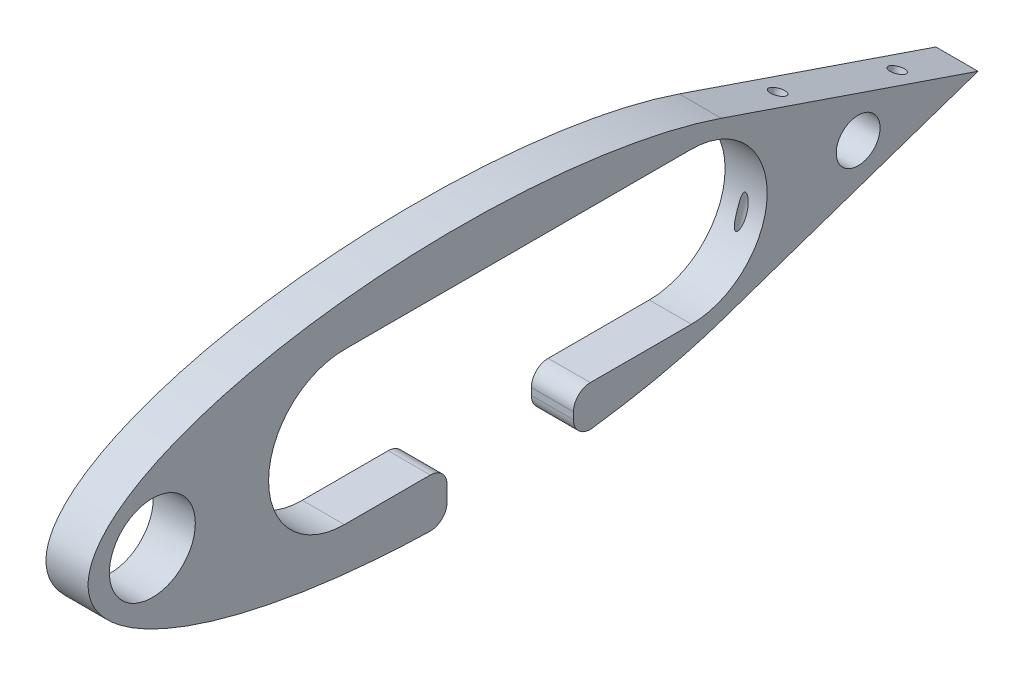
ISO-10303-21;
HEADER;
FILE_DESCRIPTION(('STEP AP214'),'2;1');
FILE_NAME('part.step','',(''),(''),'','','');
FILE_SCHEMA(('AUTOMOTIVE_DESIGN { 1 0 10303 214 1 1 1 1 }'));
ENDSEC;
DATA;
#1=APPLICATION_CONTEXT('core data for automotive mechanical design processes');
#2=APPLICATION_PROTOCOL_DEFINITION('international standard','automotive_design',2000,#1);
#3=PRODUCT_CONTEXT('',#1,'mechanical');
#4=PRODUCT('Part','Part','',(#3));
#5=PRODUCT_RELATED_PRODUCT_CATEGORY('part','',(#4));
#6=PRODUCT_DEFINITION_FORMATION('','',#4);
#7=PRODUCT_DEFINITION_CONTEXT('part definition',#1,'design');
#8=PRODUCT_DEFINITION('design','',#6,#7);
#9=PRODUCT_DEFINITION_SHAPE('','',#8);
#10=(LENGTH_UNIT() NAMED_UNIT(*) SI_UNIT(.MILLI.,.METRE.));
#11=(NAMED_UNIT(*) PLANE_ANGLE_UNIT() SI_UNIT($,.RADIAN.));
#12=(NAMED_UNIT(*) SI_UNIT($,.STERADIAN.) SOLID_ANGLE_UNIT());
#13=UNCERTAINTY_MEASURE_WITH_UNIT(LENGTH_MEASURE(1.E-05),#10,'distance_accuracy_value','');
#14=(GEOMETRIC_REPRESENTATION_CONTEXT(3) GLOBAL_UNCERTAINTY_ASSIGNED_CONTEXT((#13)) GLOBAL_UNIT_ASSIGNED_CONTEXT((#10,
#11,#12)) REPRESENTATION_CONTEXT('',''));
#15=CARTESIAN_POINT('',(0.,0.,0.));
#16=DIRECTION('',(0.,0.,1.));
#17=DIRECTION('',(1.,0.,0.));
#18=AXIS2_PLACEMENT_3D('',#15,#16,#17);
#19=CARTESIAN_POINT('',(3.175,0.,-17.1410506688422));
#20=DIRECTION('',(1.,0.,0.));
#21=DIRECTION('',(0.,0.,1.));
#22=AXIS2_PLACEMENT_3D('',#19,#20,#21);
#23=ELLIPSE('',#22,55.7894923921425,18.8157238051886);
#24=DIRECTION('',(-1.,0.,0.));
#25=VECTOR('',#24,1.);
#26=SURFACE_OF_LINEAR_EXTRUSION('',#23,#25);
#27=CARTESIAN_POINT('',(-3.175,0.,-17.1410506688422));
#28=DIRECTION('',(1.,0.,0.));
#29=DIRECTION('',(0.,0.,1.));
#30=AXIS2_PLACEMENT_3D('',#27,#28,#29);
#31=ELLIPSE('',#30,55.7894923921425,18.8157238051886);
#32=CARTESIAN_POINT('',(-3.175,13.2200854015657,-56.8395555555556));
#33=VERTEX_POINT('',#32);
#34=CARTESIAN_POINT('',(-3.175,-18.7609830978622,-12.8885338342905));
#35=VERTEX_POINT('',#34);
#36=EDGE_CURVE('E208',#33,#35,#31,.T.);
#37=ORIENTED_EDGE('',*,*,#36,.T.);
#38=DIRECTION('',(-1.,0.,0.));
#39=VECTOR('',#38,1.);
#40=CARTESIAN_POINT('',(-3.175,-18.7609830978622,-12.8885338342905));
#41=LINE('',#40,#39);
#42=CARTESIAN_POINT('',(3.175,-18.7609830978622,-12.8885338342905));
#43=VERTEX_POINT('',#42);
#44=EDGE_CURVE('E259',#35,#43,#41,.F.);
#45=ORIENTED_EDGE('',*,*,#44,.T.);
#46=CARTESIAN_POINT('',(3.175,13.2200854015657,-56.8395555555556));
#47=VERTEX_POINT('',#46);
#48=EDGE_CURVE('E211',#47,#43,#23,.T.);
#49=ORIENTED_EDGE('',*,*,#48,.F.);
#50=DIRECTION('',(-1.,0.,0.));
#51=VECTOR('',#50,1.);
#52=CARTESIAN_POINT('',(3.175,13.2200854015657,-56.8395555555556));
#53=LINE('',#52,#51);
#54=EDGE_CURVE('E261',#47,#33,#53,.T.);
#55=ORIENTED_EDGE('',*,*,#54,.T.);
#56=EDGE_LOOP('',(#37,#45,#49,#55));
#57=FACE_BOUND('',#56,.T.);
#58=ADVANCED_FACE('F38',(#57),#26,.F.);
#59=CARTESIAN_POINT('',(3.175,-11.43,0.));
#60=DIRECTION('',(0.,1.,0.));
#61=DIRECTION('',(0.,0.,1.));
#62=AXIS2_PLACEMENT_3D('',#59,#60,#61);
#63=PLANE('',#62);
#64=DIRECTION('',(0.,0.,-1.));
#65=VECTOR('',#64,1.);
#66=CARTESIAN_POINT('',(3.175,-11.43,0.));
#67=LINE('',#66,#65);
#68=CARTESIAN_POINT('',(3.175,-11.43,0.));
#69=VERTEX_POINT('',#68);
#70=CARTESIAN_POINT('',(3.175,-11.43,-12.954));
#71=VERTEX_POINT('',#70);
#72=EDGE_CURVE('E163',#69,#71,#67,.T.);
#73=ORIENTED_EDGE('',*,*,#72,.T.);
#74=DIRECTION('',(1.,0.,0.));
#75=VECTOR('',#74,1.);
#76=CARTESIAN_POINT('',(-3.175,-11.43,-12.954));
#77=LINE('',#76,#75);
#78=CARTESIAN_POINT('',(-3.175,-11.43,-12.954));
#79=VERTEX_POINT('',#78);
#80=EDGE_CURVE('E11',#71,#79,#77,.F.);
#81=ORIENTED_EDGE('',*,*,#80,.T.);
#82=DIRECTION('',(0.,0.,-1.));
#83=VECTOR('',#82,1.);
#84=CARTESIAN_POINT('',(-3.175,-11.43,0.));
#85=LINE('',#84,#83);
#86=CARTESIAN_POINT('',(-3.175,-11.43,0.));
#87=VERTEX_POINT('',#86);
#88=EDGE_CURVE('E166',#87,#79,#85,.T.);
#89=ORIENTED_EDGE('',*,*,#88,.F.);
#90=DIRECTION('',(-1.,0.,0.));
#91=VECTOR('',#90,1.);
#92=CARTESIAN_POINT('',(3.175,-11.43,0.));
#93=LINE('',#92,#91);
#94=EDGE_CURVE('E150',#69,#87,#93,.T.);
#95=ORIENTED_EDGE('',*,*,#94,.F.);
#96=EDGE_LOOP('',(#73,#81,#89,#95));
#97=FACE_BOUND('',#96,.T.);
#98=ADVANCED_FACE('F162',(#97),#63,.T.);
#99=CARTESIAN_POINT('',(3.175,0.,-17.1410506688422));
#100=DIRECTION('',(1.,0.,0.));
#101=DIRECTION('',(0.,0.,-1.));
#102=AXIS2_PLACEMENT_3D('',#99,#100,#101);
#103=PLANE('',#102);
#104=DIRECTION('',(0.,1.,0.));
#105=VECTOR('',#104,1.);
#106=CARTESIAN_POINT('',(3.175,-11.43,-34.544));
#107=LINE('',#106,#105);
#108=CARTESIAN_POINT('',(3.175,-15.0110063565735,-34.544));
#109=VERTEX_POINT('',#108);
#110=CARTESIAN_POINT('',(3.175,-13.97,-34.544));
#111=VERTEX_POINT('',#110);
#112=EDGE_CURVE('E286',#109,#111,#107,.T.);
#113=ORIENTED_EDGE('',*,*,#112,.F.);
#114=CARTESIAN_POINT('',(3.175,-15.0110063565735,-37.084));
#115=DIRECTION('',(1.,0.,0.));
#116=DIRECTION('',(0.,0.,-1.));
#117=AXIS2_PLACEMENT_3D('',#114,#115,#116);
#118=CIRCLE('',#117,2.54);
#119=CARTESIAN_POINT('',(3.175,-17.5293071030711,-37.4153025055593));
#120=VERTEX_POINT('',#119);
#121=EDGE_CURVE('E271',#109,#120,#118,.T.);
#122=ORIENTED_EDGE('',*,*,#121,.T.);
#123=CARTESIAN_POINT('',(3.175,-13.2200854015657,-56.8395555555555));
#124=VERTEX_POINT('',#123);
#125=EDGE_CURVE('E210',#120,#124,#23,.T.);
#126=ORIENTED_EDGE('',*,*,#125,.T.);
#127=DIRECTION('',(0.,0.323232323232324,-0.946319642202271));
#128=VECTOR('',#127,1.);
#129=CARTESIAN_POINT('',(3.175,0.,-95.5436874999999));
#130=LINE('',#129,#128);
#131=CARTESIAN_POINT('',(3.175,0.,-95.5436874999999));
#132=VERTEX_POINT('',#131);
#133=EDGE_CURVE('E204',#124,#132,#130,.T.);
#134=ORIENTED_EDGE('',*,*,#133,.T.);
#135=DIRECTION('',(0.,0.323232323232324,0.946319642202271));
#136=VECTOR('',#135,1.);
#137=CARTESIAN_POINT('',(3.175,13.2200854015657,-56.8395555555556));
#138=LINE('',#137,#136);
#139=EDGE_CURVE('E207',#132,#47,#138,.T.);
#140=ORIENTED_EDGE('',*,*,#139,.T.);
#141=ORIENTED_EDGE('',*,*,#48,.T.);
#142=CARTESIAN_POINT('',(3.175,-16.2218269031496,-12.954));
#143=DIRECTION('',(1.,0.,0.));
#144=DIRECTION('',(0.,0.,-1.));
#145=AXIS2_PLACEMENT_3D('',#142,#143,#144);
#146=CIRCLE('',#145,2.54);
#147=CARTESIAN_POINT('',(3.175,-16.2218269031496,-15.494));
#148=VERTEX_POINT('',#147);
#149=EDGE_CURVE('E53',#43,#148,#146,.T.);
#150=ORIENTED_EDGE('',*,*,#149,.T.);
#151=DIRECTION('',(0.,-1.,0.));
#152=VECTOR('',#151,1.);
#153=CARTESIAN_POINT('',(3.175,-11.43,-15.494));
#154=LINE('',#153,#152);
#155=CARTESIAN_POINT('',(3.175,-13.97,-15.494));
#156=VERTEX_POINT('',#155);
#157=EDGE_CURVE('E280',#156,#148,#154,.T.);
#158=ORIENTED_EDGE('',*,*,#157,.F.);
#159=CARTESIAN_POINT('',(3.175,-13.97,-12.954));
#160=DIRECTION('',(1.,0.,0.));
#161=DIRECTION('',(0.,0.,-1.));
#162=AXIS2_PLACEMENT_3D('',#159,#160,#161);
#163=CIRCLE('',#162,2.54);
#164=EDGE_CURVE('E174',#156,#71,#163,.T.);
#165=ORIENTED_EDGE('',*,*,#164,.T.);
#166=ORIENTED_EDGE('',*,*,#72,.F.);
#167=CARTESIAN_POINT('',(3.175,0.,0.));
#168=DIRECTION('',(1.,0.,0.));
#169=DIRECTION('',(0.,0.,-1.));
#170=AXIS2_PLACEMENT_3D('',#167,#168,#169);
#171=CIRCLE('',#170,11.43);
#172=CARTESIAN_POINT('',(3.175,11.43,0.));
#173=VERTEX_POINT('',#172);
#174=EDGE_CURVE('E147',#173,#69,#171,.T.);
#175=ORIENTED_EDGE('',*,*,#174,.F.);
#176=DIRECTION('',(0.,0.,1.));
#177=VECTOR('',#176,1.);
#178=CARTESIAN_POINT('',(3.175,11.43,0.));
#179=LINE('',#178,#177);
#180=CARTESIAN_POINT('',(3.175,11.43,-52.324));
#181=VERTEX_POINT('',#180);
#182=EDGE_CURVE('E178',#181,#173,#179,.T.);
#183=ORIENTED_EDGE('',*,*,#182,.F.);
#184=CARTESIAN_POINT('',(3.175,0.,-52.324));
#185=DIRECTION('',(1.,0.,0.));
#186=DIRECTION('',(0.,0.,-1.));
#187=AXIS2_PLACEMENT_3D('',#184,#185,#186);
#188=CIRCLE('',#187,11.43);
#189=CARTESIAN_POINT('',(3.175,-11.43,-52.324));
#190=VERTEX_POINT('',#189);
#191=EDGE_CURVE('E175',#190,#181,#188,.T.);
#192=ORIENTED_EDGE('',*,*,#191,.F.);
#193=CARTESIAN_POINT('',(3.175,-11.43,-37.084));
#194=VERTEX_POINT('',#193);
#195=EDGE_CURVE('E157',#194,#190,#67,.T.);
#196=ORIENTED_EDGE('',*,*,#195,.F.);
#197=CARTESIAN_POINT('',(3.175,-13.97,-37.084));
#198=DIRECTION('',(1.,0.,0.));
#199=DIRECTION('',(0.,0.,-1.));
#200=AXIS2_PLACEMENT_3D('',#197,#198,#199);
#201=CIRCLE('',#200,2.54);
#202=EDGE_CURVE('E61',#194,#111,#201,.T.);
#203=ORIENTED_EDGE('',*,*,#202,.T.);
#204=EDGE_LOOP('',(#113,#122,#126,#134,#140,#141,#150,#158,#165,#166,#175,#183,#192,#196,#203));
#205=FACE_BOUND('',#204,.T.);
#206=CARTESIAN_POINT('',(3.175,0.,-77.47));
#207=DIRECTION('',(1.,0.,0.));
#208=DIRECTION('',(0.,0.,-1.));
#209=AXIS2_PLACEMENT_3D('',#206,#207,#208);
#210=CIRCLE('',#209,3.302);
#211=CARTESIAN_POINT('',(3.175,0.,-80.772));
#212=VERTEX_POINT('',#211);
#213=EDGE_CURVE('E198',#212,#212,#210,.T.);
#214=ORIENTED_EDGE('',*,*,#213,.F.);
#215=EDGE_LOOP('',(#214));
#216=FACE_BOUND('',#215,.T.);
#217=CARTESIAN_POINT('',(3.175,0.,28.956));
#218=DIRECTION('',(1.,0.,0.));
#219=DIRECTION('',(0.,0.,-1.));
#220=AXIS2_PLACEMENT_3D('',#217,#218,#219);
#221=CIRCLE('',#220,6.477);
#222=CARTESIAN_POINT('',(3.175,0.,22.479));
#223=VERTEX_POINT('',#222);
#224=EDGE_CURVE('E186',#223,#223,#221,.T.);
#225=ORIENTED_EDGE('',*,*,#224,.F.);
#226=EDGE_LOOP('',(#225));
#227=FACE_BOUND('',#226,.T.);
#228=ADVANCED_FACE('F171',(#205,#216,#227),#103,.T.);
#229=CARTESIAN_POINT('',(-3.175,0.,-17.1410506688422));
#230=DIRECTION('',(1.,0.,0.));
#231=DIRECTION('',(0.,0.,-1.));
#232=AXIS2_PLACEMENT_3D('',#229,#230,#231);
#233=PLANE('',#232);
#234=CARTESIAN_POINT('',(-3.175,0.,-77.47));
#235=DIRECTION('',(1.,0.,0.));
#236=DIRECTION('',(0.,0.,-1.));
#237=AXIS2_PLACEMENT_3D('',#234,#235,#236);
#238=CIRCLE('',#237,3.302);
#239=CARTESIAN_POINT('',(-3.175,0.,-80.772));
#240=VERTEX_POINT('',#239);
#241=EDGE_CURVE('E167',#240,#240,#238,.T.);
#242=ORIENTED_EDGE('',*,*,#241,.T.);
#243=EDGE_LOOP('',(#242));
#244=FACE_BOUND('',#243,.T.);
#245=CARTESIAN_POINT('',(-3.175,-17.5293071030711,-37.4153025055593));
#246=VERTEX_POINT('',#245);
#247=CARTESIAN_POINT('',(-3.175,-13.2200854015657,-56.8395555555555));
#248=VERTEX_POINT('',#247);
#249=EDGE_CURVE('E263',#246,#248,#31,.T.);
#250=ORIENTED_EDGE('',*,*,#249,.F.);
#251=CARTESIAN_POINT('',(-3.175,-15.0110063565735,-37.084));
#252=DIRECTION('',(1.,0.,0.));
#253=DIRECTION('',(0.,0.,-1.));
#254=AXIS2_PLACEMENT_3D('',#251,#252,#253);
#255=CIRCLE('',#254,2.54);
#256=CARTESIAN_POINT('',(-3.175,-15.0110063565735,-34.544));
#257=VERTEX_POINT('',#256);
#258=EDGE_CURVE('E351',#246,#257,#255,.F.);
#259=ORIENTED_EDGE('',*,*,#258,.T.);
#260=DIRECTION('',(0.,1.,0.));
#261=VECTOR('',#260,1.);
#262=CARTESIAN_POINT('',(-3.175,-11.43,-34.544));
#263=LINE('',#262,#261);
#264=CARTESIAN_POINT('',(-3.175,-13.97,-34.544));
#265=VERTEX_POINT('',#264);
#266=EDGE_CURVE('E285',#257,#265,#263,.T.);
#267=ORIENTED_EDGE('',*,*,#266,.T.);
#268=CARTESIAN_POINT('',(-3.175,-13.97,-37.084));
#269=DIRECTION('',(1.,0.,0.));
#270=DIRECTION('',(0.,0.,-1.));
#271=AXIS2_PLACEMENT_3D('',#268,#269,#270);
#272=CIRCLE('',#271,2.54);
#273=CARTESIAN_POINT('',(-3.175,-11.43,-37.084));
#274=VERTEX_POINT('',#273);
#275=EDGE_CURVE('E349',#265,#274,#272,.F.);
#276=ORIENTED_EDGE('',*,*,#275,.T.);
#277=CARTESIAN_POINT('',(-3.175,-11.43,-52.324));
#278=VERTEX_POINT('',#277);
#279=EDGE_CURVE('E185',#274,#278,#85,.T.);
#280=ORIENTED_EDGE('',*,*,#279,.T.);
#281=CARTESIAN_POINT('',(-3.175,0.,-52.324));
#282=DIRECTION('',(1.,0.,0.));
#283=DIRECTION('',(0.,0.,-1.));
#284=AXIS2_PLACEMENT_3D('',#281,#282,#283);
#285=CIRCLE('',#284,11.43);
#286=CARTESIAN_POINT('',(-3.175,11.43,-52.324));
#287=VERTEX_POINT('',#286);
#288=EDGE_CURVE('E188',#278,#287,#285,.T.);
#289=ORIENTED_EDGE('',*,*,#288,.T.);
#290=DIRECTION('',(0.,0.,1.));
#291=VECTOR('',#290,1.);
#292=CARTESIAN_POINT('',(-3.175,11.43,0.));
#293=LINE('',#292,#291);
#294=CARTESIAN_POINT('',(-3.175,11.43,0.));
#295=VERTEX_POINT('',#294);
#296=EDGE_CURVE('E158',#287,#295,#293,.T.);
#297=ORIENTED_EDGE('',*,*,#296,.T.);
#298=CARTESIAN_POINT('',(-3.175,0.,0.));
#299=DIRECTION('',(1.,0.,0.));
#300=DIRECTION('',(0.,0.,-1.));
#301=AXIS2_PLACEMENT_3D('',#298,#299,#300);
#302=CIRCLE('',#301,11.43);
#303=EDGE_CURVE('E183',#295,#87,#302,.T.);
#304=ORIENTED_EDGE('',*,*,#303,.T.);
#305=ORIENTED_EDGE('',*,*,#88,.T.);
#306=CARTESIAN_POINT('',(-3.175,-13.97,-12.954));
#307=DIRECTION('',(1.,0.,0.));
#308=DIRECTION('',(0.,0.,-1.));
#309=AXIS2_PLACEMENT_3D('',#306,#307,#308);
#310=CIRCLE('',#309,2.54);
#311=CARTESIAN_POINT('',(-3.175,-13.97,-15.494));
#312=VERTEX_POINT('',#311);
#313=EDGE_CURVE('E284',#79,#312,#310,.F.);
#314=ORIENTED_EDGE('',*,*,#313,.T.);
#315=DIRECTION('',(0.,-1.,0.));
#316=VECTOR('',#315,1.);
#317=CARTESIAN_POINT('',(-3.175,-11.43,-15.494));
#318=LINE('',#317,#316);
#319=CARTESIAN_POINT('',(-3.175,-16.2218269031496,-15.494));
#320=VERTEX_POINT('',#319);
#321=EDGE_CURVE('E278',#312,#320,#318,.T.);
#322=ORIENTED_EDGE('',*,*,#321,.T.);
#323=CARTESIAN_POINT('',(-3.175,-16.2218269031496,-12.954));
#324=DIRECTION('',(1.,0.,0.));
#325=DIRECTION('',(0.,0.,-1.));
#326=AXIS2_PLACEMENT_3D('',#323,#324,#325);
#327=CIRCLE('',#326,2.54);
#328=EDGE_CURVE('E265',#320,#35,#327,.F.);
#329=ORIENTED_EDGE('',*,*,#328,.T.);
#330=ORIENTED_EDGE('',*,*,#36,.F.);
#331=DIRECTION('',(0.,0.323232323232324,0.946319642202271));
#332=VECTOR('',#331,1.);
#333=CARTESIAN_POINT('',(-3.175,13.2200854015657,-56.8395555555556));
#334=LINE('',#333,#332);
#335=CARTESIAN_POINT('',(-3.175,0.,-95.5436874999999));
#336=VERTEX_POINT('',#335);
#337=EDGE_CURVE('E382',#336,#33,#334,.T.);
#338=ORIENTED_EDGE('',*,*,#337,.F.);
#339=DIRECTION('',(0.,0.323232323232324,-0.946319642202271));
#340=VECTOR('',#339,1.);
#341=CARTESIAN_POINT('',(-3.175,0.,-95.5436874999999));
#342=LINE('',#341,#340);
#343=EDGE_CURVE('E201',#248,#336,#342,.T.);
#344=ORIENTED_EDGE('',*,*,#343,.F.);
#345=EDGE_LOOP('',(#250,#259,#267,#276,#280,#289,#297,#304,#305,#314,#322,#329,#330,#338,#344));
#346=FACE_BOUND('',#345,.T.);
#347=CARTESIAN_POINT('',(-3.175,0.,28.956));
#348=DIRECTION('',(1.,0.,0.));
#349=DIRECTION('',(0.,0.,-1.));
#350=AXIS2_PLACEMENT_3D('',#347,#348,#349);
#351=CIRCLE('',#350,6.477);
#352=CARTESIAN_POINT('',(-3.175,0.,22.479));
#353=VERTEX_POINT('',#352);
#354=EDGE_CURVE('E307',#353,#353,#351,.T.);
#355=ORIENTED_EDGE('',*,*,#354,.T.);
#356=EDGE_LOOP('',(#355));
#357=FACE_BOUND('',#356,.T.);
#358=ADVANCED_FACE('F225',(#244,#346,#357),#233,.F.);
#359=CARTESIAN_POINT('',(3.175,0.,-95.5436874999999));
#360=DIRECTION('',(0.,0.946319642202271,0.323232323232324));
#361=DIRECTION('',(0.,-0.323232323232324,0.946319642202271));
#362=AXIS2_PLACEMENT_3D('',#359,#360,#361);
#363=PLANE('',#362);
#364=CARTESIAN_POINT('',(0.,-3.89206758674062,-84.1489731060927));
#365=DIRECTION('',(0.,0.946319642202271,0.323232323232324));
#366=DIRECTION('',(0.,0.323232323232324,-0.946319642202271));
#367=AXIS2_PLACEMENT_3D('',#364,#365,#366);
#368=ELLIPSE('',#367,1.42887531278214,1.13029999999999);
#369=CARTESIAN_POINT('',(0.,-3.43020889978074,-85.5011458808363));
#370=VERTEX_POINT('',#369);
#371=EDGE_CURVE('E297',#370,#370,#368,.T.);
#372=ORIENTED_EDGE('',*,*,#371,.T.);
#373=EDGE_LOOP('',(#372));
#374=FACE_BOUND('',#373,.T.);
#375=CARTESIAN_POINT('',(0.,-11.6762027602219,-61.3595443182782));
#376=DIRECTION('',(0.,0.946319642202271,0.323232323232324));
#377=DIRECTION('',(0.,0.323232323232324,-0.946319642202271));
#378=AXIS2_PLACEMENT_3D('',#375,#376,#377);
#379=ELLIPSE('',#378,1.42887531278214,1.13029999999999);
#380=CARTESIAN_POINT('',(0.,-11.214344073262,-62.7117170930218));
#381=VERTEX_POINT('',#380);
#382=EDGE_CURVE('E304',#381,#381,#379,.T.);
#383=ORIENTED_EDGE('',*,*,#382,.T.);
#384=EDGE_LOOP('',(#383));
#385=FACE_BOUND('',#384,.T.);
#386=ORIENTED_EDGE('',*,*,#343,.T.);
#387=DIRECTION('',(-1.,0.,0.));
#388=VECTOR('',#387,1.);
#389=CARTESIAN_POINT('',(3.175,0.,-95.5436874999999));
#390=LINE('',#389,#388);
#391=EDGE_CURVE('E342',#132,#336,#390,.T.);
#392=ORIENTED_EDGE('',*,*,#391,.F.);
#393=ORIENTED_EDGE('',*,*,#133,.F.);
#394=DIRECTION('',(-1.,0.,0.));
#395=VECTOR('',#394,1.);
#396=CARTESIAN_POINT('',(3.175,-13.2200854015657,-56.8395555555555));
#397=LINE('',#396,#395);
#398=EDGE_CURVE('E215',#124,#248,#397,.T.);
#399=ORIENTED_EDGE('',*,*,#398,.T.);
#400=EDGE_LOOP('',(#386,#392,#393,#399));
#401=FACE_BOUND('',#400,.T.);
#402=ADVANCED_FACE('F229',(#374,#385,#401),#363,.F.);
#403=CARTESIAN_POINT('',(3.175,13.2200854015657,-56.8395555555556));
#404=DIRECTION('',(0.,-0.946319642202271,0.323232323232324));
#405=DIRECTION('',(0.,-0.323232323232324,-0.946319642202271));
#406=AXIS2_PLACEMENT_3D('',#403,#404,#405);
#407=PLANE('',#406);
#408=CARTESIAN_POINT('',(0.,3.07878787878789,-86.5299929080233));
#409=DIRECTION('',(0.,0.946319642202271,-0.323232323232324));
#410=DIRECTION('',(0.,0.323232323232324,0.946319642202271));
#411=AXIS2_PLACEMENT_3D('',#408,#409,#410);
#412=CIRCLE('',#411,1.13029999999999);
#413=CARTESIAN_POINT('',(0.,3.44413737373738,-85.4603678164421));
#414=VERTEX_POINT('',#413);
#415=EDGE_CURVE('E289',#414,#414,#412,.T.);
#416=ORIENTED_EDGE('',*,*,#415,.F.);
#417=EDGE_LOOP('',(#416));
#418=FACE_BOUND('',#417,.T.);
#419=CARTESIAN_POINT('',(0.,9.23636363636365,-68.5026037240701));
#420=DIRECTION('',(0.,0.946319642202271,-0.323232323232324));
#421=DIRECTION('',(0.,0.323232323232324,0.946319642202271));
#422=AXIS2_PLACEMENT_3D('',#419,#420,#421);
#423=CIRCLE('',#422,1.13029999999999);
#424=CARTESIAN_POINT('',(0.,9.60171313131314,-67.4329786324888));
#425=VERTEX_POINT('',#424);
#426=EDGE_CURVE('E300',#425,#425,#423,.T.);
#427=ORIENTED_EDGE('',*,*,#426,.F.);
#428=EDGE_LOOP('',(#427));
#429=FACE_BOUND('',#428,.T.);
#430=ORIENTED_EDGE('',*,*,#337,.T.);
#431=ORIENTED_EDGE('',*,*,#54,.F.);
#432=ORIENTED_EDGE('',*,*,#139,.F.);
#433=ORIENTED_EDGE('',*,*,#391,.T.);
#434=EDGE_LOOP('',(#430,#431,#432,#433));
#435=FACE_BOUND('',#434,.T.);
#436=ADVANCED_FACE('F223',(#418,#429,#435),#407,.F.);
#437=ORIENTED_EDGE('',*,*,#125,.F.);
#438=DIRECTION('',(-1.,0.,0.));
#439=VECTOR('',#438,1.);
#440=CARTESIAN_POINT('',(3.175,-17.5293071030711,-37.4153025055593));
#441=LINE('',#440,#439);
#442=EDGE_CURVE('E344',#120,#246,#441,.T.);
#443=ORIENTED_EDGE('',*,*,#442,.T.);
#444=ORIENTED_EDGE('',*,*,#249,.T.);
#445=ORIENTED_EDGE('',*,*,#398,.F.);
#446=EDGE_LOOP('',(#437,#443,#444,#445));
#447=FACE_BOUND('',#446,.T.);
#448=ADVANCED_FACE('F218',(#447),#26,.F.);
#449=CARTESIAN_POINT('',(3.175,0.,-77.47));
#450=DIRECTION('',(-1.,0.,0.));
#451=DIRECTION('',(0.,0.,1.));
#452=AXIS2_PLACEMENT_3D('',#449,#450,#451);
#453=CYLINDRICAL_SURFACE('',#452,3.302);
#454=ORIENTED_EDGE('',*,*,#213,.T.);
#455=EDGE_LOOP('',(#454));
#456=FACE_BOUND('',#455,.T.);
#457=ORIENTED_EDGE('',*,*,#241,.F.);
#458=EDGE_LOOP('',(#457));
#459=FACE_BOUND('',#458,.T.);
#460=ADVANCED_FACE('F222',(#456,#459),#453,.F.);
#461=CARTESIAN_POINT('',(3.175,0.,0.));
#462=DIRECTION('',(-1.,0.,0.));
#463=DIRECTION('',(0.,0.,1.));
#464=AXIS2_PLACEMENT_3D('',#461,#462,#463);
#465=CYLINDRICAL_SURFACE('',#464,11.43);
#466=ORIENTED_EDGE('',*,*,#303,.F.);
#467=DIRECTION('',(-1.,0.,0.));
#468=VECTOR('',#467,1.);
#469=CARTESIAN_POINT('',(3.175,11.43,0.));
#470=LINE('',#469,#468);
#471=EDGE_CURVE('E153',#173,#295,#470,.T.);
#472=ORIENTED_EDGE('',*,*,#471,.F.);
#473=ORIENTED_EDGE('',*,*,#174,.T.);
#474=ORIENTED_EDGE('',*,*,#94,.T.);
#475=EDGE_LOOP('',(#466,#472,#473,#474));
#476=FACE_BOUND('',#475,.T.);
#477=ADVANCED_FACE('F149',(#476),#465,.F.);
#478=ORIENTED_EDGE('',*,*,#279,.F.);
#479=DIRECTION('',(1.,0.,0.));
#480=VECTOR('',#479,1.);
#481=CARTESIAN_POINT('',(3.175,-11.43,-37.084));
#482=LINE('',#481,#480);
#483=EDGE_CURVE('E267',#274,#194,#482,.T.);
#484=ORIENTED_EDGE('',*,*,#483,.T.);
#485=ORIENTED_EDGE('',*,*,#195,.T.);
#486=DIRECTION('',(-1.,0.,0.));
#487=VECTOR('',#486,1.);
#488=CARTESIAN_POINT('',(3.175,-11.43,-52.324));
#489=LINE('',#488,#487);
#490=EDGE_CURVE('E168',#190,#278,#489,.T.);
#491=ORIENTED_EDGE('',*,*,#490,.T.);
#492=EDGE_LOOP('',(#478,#484,#485,#491));
#493=FACE_BOUND('',#492,.T.);
#494=ADVANCED_FACE('F254',(#493),#63,.T.);
#495=CARTESIAN_POINT('',(3.175,0.,-52.324));
#496=DIRECTION('',(-1.,0.,0.));
#497=DIRECTION('',(0.,0.,1.));
#498=AXIS2_PLACEMENT_3D('',#495,#496,#497);
#499=CYLINDRICAL_SURFACE('',#498,11.43);
#500=CARTESIAN_POINT('',(0.,-5.80346297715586,-62.1710664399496));
#501=CARTESIAN_POINT('',(0.0137817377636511,-5.80346114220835,-62.1710675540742));
#502=CARTESIAN_POINT('',(0.0275768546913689,-5.80237523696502,-62.1717077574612));
#503=CARTESIAN_POINT('',(0.0547420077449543,-5.79815119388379,-62.174195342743));
#504=CARTESIAN_POINT('',(0.0681112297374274,-5.79500934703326,-62.1760449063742));
#505=CARTESIAN_POINT('',(0.0976142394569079,-5.78589409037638,-62.181401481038));
#506=CARTESIAN_POINT('',(0.113523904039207,-5.77938623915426,-62.18522056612));
#507=CARTESIAN_POINT('',(0.143931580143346,-5.76426298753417,-62.1940683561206));
#508=CARTESIAN_POINT('',(0.158426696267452,-5.75564338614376,-62.1990994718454));
#509=CARTESIAN_POINT('',(0.195336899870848,-5.73059373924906,-62.2136673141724));
#510=CARTESIAN_POINT('',(0.216520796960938,-5.71281004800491,-62.2239583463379));
#511=CARTESIAN_POINT('',(0.255763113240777,-5.67477912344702,-62.2458077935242));
#512=CARTESIAN_POINT('',(0.273812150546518,-5.65452479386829,-62.2573698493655));
#513=CARTESIAN_POINT('',(0.313276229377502,-5.60518781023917,-62.2853163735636));
#514=CARTESIAN_POINT('',(0.333692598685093,-5.5754767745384,-62.301984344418));
#515=CARTESIAN_POINT('',(0.3712669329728,-5.51434413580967,-62.3358999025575));
#516=CARTESIAN_POINT('',(0.388418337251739,-5.48291924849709,-62.3531485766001));
#517=CARTESIAN_POINT('',(0.420257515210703,-5.41880047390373,-62.3879374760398));
#518=CARTESIAN_POINT('',(0.434934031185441,-5.38610157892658,-62.405478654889));
#519=CARTESIAN_POINT('',(0.462234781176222,-5.31991400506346,-62.4405616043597));
#520=CARTESIAN_POINT('',(0.474860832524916,-5.28642605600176,-62.458103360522));
#521=CARTESIAN_POINT('',(0.504733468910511,-5.20080565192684,-62.5024045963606));
#522=CARTESIAN_POINT('',(0.520857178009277,-5.14824672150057,-62.5290950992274));
#523=CARTESIAN_POINT('',(0.550073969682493,-5.04204126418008,-62.5819845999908));
#524=CARTESIAN_POINT('',(0.563165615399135,-4.98839423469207,-62.6081833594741));
#525=CARTESIAN_POINT('',(0.598818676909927,-4.82600185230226,-62.6859016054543));
#526=CARTESIAN_POINT('',(0.617701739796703,-4.71598172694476,-62.736451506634));
#527=CARTESIAN_POINT('',(0.648446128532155,-4.49308320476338,-62.8345674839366));
#528=CARTESIAN_POINT('',(0.66027330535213,-4.38019362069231,-62.8821180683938));
#529=CARTESIAN_POINT('',(0.678079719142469,-4.15270104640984,-62.9736472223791));
#530=CARTESIAN_POINT('',(0.684066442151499,-4.03810044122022,-63.0176302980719));
#531=CARTESIAN_POINT('',(0.692138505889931,-3.76405330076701,-63.1177642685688));
#532=CARTESIAN_POINT('',(0.691912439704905,-3.60393717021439,-63.1722768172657));
#533=CARTESIAN_POINT('',(0.681674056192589,-3.28129516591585,-63.2741904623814));
#534=CARTESIAN_POINT('',(0.671637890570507,-3.11876437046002,-63.3215739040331));
#535=CARTESIAN_POINT('',(0.647677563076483,-2.87487330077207,-63.3868676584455));
#536=CARTESIAN_POINT('',(0.638249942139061,-2.79381565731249,-63.4076123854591));
#537=CARTESIAN_POINT('',(0.615885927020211,-2.63173002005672,-63.4472121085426));
#538=CARTESIAN_POINT('',(0.602950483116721,-2.55070202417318,-63.4660676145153));
#539=CARTESIAN_POINT('',(0.572789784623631,-2.38932203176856,-63.5017836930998));
#540=CARTESIAN_POINT('',(0.555580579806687,-2.30896864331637,-63.5186513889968));
#541=CARTESIAN_POINT('',(0.515521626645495,-2.14930816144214,-63.5503960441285));
#542=CARTESIAN_POINT('',(0.492678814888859,-2.06999990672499,-63.5652754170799));
#543=CARTESIAN_POINT('',(0.4542134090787,-1.95836065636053,-63.5850342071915));
#544=CARTESIAN_POINT('',(0.441905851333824,-1.92504049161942,-63.5907759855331));
#545=CARTESIAN_POINT('',(0.415434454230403,-1.85902939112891,-63.6018556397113));
#546=CARTESIAN_POINT('',(0.401268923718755,-1.82633906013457,-63.6071931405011));
#547=CARTESIAN_POINT('',(0.370724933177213,-1.76212996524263,-63.6173984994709));
#548=CARTESIAN_POINT('',(0.354358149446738,-1.73060606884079,-63.6222686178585));
#549=CARTESIAN_POINT('',(0.318733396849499,-1.66918184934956,-63.6315059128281));
#550=CARTESIAN_POINT('',(0.29948081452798,-1.63927863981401,-63.6358740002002));
#551=CARTESIAN_POINT('',(0.262007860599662,-1.58878751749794,-63.6430612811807));
#552=CARTESIAN_POINT('',(0.244573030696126,-1.56764151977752,-63.6460053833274));
#553=CARTESIAN_POINT('',(0.20684220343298,-1.52798845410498,-63.6514245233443));
#554=CARTESIAN_POINT('',(0.186554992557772,-1.50947362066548,-63.6539009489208));
#555=CARTESIAN_POINT('',(0.151919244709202,-1.48380615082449,-63.6572833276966));
#556=CARTESIAN_POINT('',(0.138704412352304,-1.47516621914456,-63.658409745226));
#557=CARTESIAN_POINT('',(0.11113230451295,-1.4598941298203,-63.6603869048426));
#558=CARTESIAN_POINT('',(0.0967765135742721,-1.45325941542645,-63.6612379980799));
#559=CARTESIAN_POINT('',(0.0692840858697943,-1.44338690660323,-63.6624988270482));
#560=CARTESIAN_POINT('',(0.0562795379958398,-1.43979261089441,-63.6629551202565));
#561=CARTESIAN_POINT('',(0.0298453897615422,-1.43483728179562,-63.6635832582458));
#562=CARTESIAN_POINT('',(0.0164161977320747,-1.43347416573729,-63.6637553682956));
#563=CARTESIAN_POINT('',(-0.0104999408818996,-1.43312698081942,-63.663799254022));
#564=CARTESIAN_POINT('',(-0.0239869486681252,-1.43414741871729,-63.6636704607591));
#565=CARTESIAN_POINT('',(-0.0505863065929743,-1.43846183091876,-63.663123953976));
#566=CARTESIAN_POINT('',(-0.0636983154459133,-1.44175781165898,-63.662705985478));
#567=CARTESIAN_POINT('',(-0.0926811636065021,-1.45146117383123,-63.6614684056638));
#568=CARTESIAN_POINT('',(-0.108346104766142,-1.45846678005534,-63.6605710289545));
#569=CARTESIAN_POINT('',(-0.138343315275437,-1.47486137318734,-63.6584498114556));
#570=CARTESIAN_POINT('',(-0.152672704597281,-1.48425535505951,-63.657225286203));
#571=CARTESIAN_POINT('',(-0.188904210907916,-1.5114157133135,-63.6536429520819));
#572=CARTESIAN_POINT('',(-0.209668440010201,-1.53065310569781,-63.6510661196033));
#573=CARTESIAN_POINT('',(-0.248211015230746,-1.57182697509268,-63.6454264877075));
#574=CARTESIAN_POINT('',(-0.265980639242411,-1.59377102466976,-63.6423623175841));
#575=CARTESIAN_POINT('',(-0.304445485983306,-1.64658256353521,-63.6348170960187));
#576=CARTESIAN_POINT('',(-0.324262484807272,-1.67806162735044,-63.630196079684));
#577=CARTESIAN_POINT('',(-0.360841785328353,-1.74269171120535,-63.6204154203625));
#578=CARTESIAN_POINT('',(-0.377598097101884,-1.77584585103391,-63.6152547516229));
#579=CARTESIAN_POINT('',(-0.408792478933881,-1.84332922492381,-63.6044348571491));
#580=CARTESIAN_POINT('',(-0.423219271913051,-1.87766325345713,-63.5987734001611));
#581=CARTESIAN_POINT('',(-0.450127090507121,-1.94696593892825,-63.5870129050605));
#582=CARTESIAN_POINT('',(-0.462609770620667,-1.98193402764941,-63.5809142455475));
#583=CARTESIAN_POINT('',(-0.492229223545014,-2.07108776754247,-63.564929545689));
#584=CARTESIAN_POINT('',(-0.508297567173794,-2.12557634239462,-63.5547582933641));
#585=CARTESIAN_POINT('',(-0.537547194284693,-2.23514775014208,-63.5334664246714));
#586=CARTESIAN_POINT('',(-0.550727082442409,-2.29023085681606,-63.5223453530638));
#587=CARTESIAN_POINT('',(-0.586817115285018,-2.45613079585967,-63.4875605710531));
#588=CARTESIAN_POINT('',(-0.606223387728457,-2.56742057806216,-63.4625069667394));
#589=CARTESIAN_POINT('',(-0.638353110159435,-2.7903672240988,-63.4087625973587));
#590=CARTESIAN_POINT('',(-0.651057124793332,-2.90202422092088,-63.3800615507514));
#591=CARTESIAN_POINT('',(-0.671008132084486,-3.12474805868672,-63.3191882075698));
#592=CARTESIAN_POINT('',(-0.678260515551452,-3.23581537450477,-63.2870193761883));
#593=CARTESIAN_POINT('',(-0.689313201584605,-3.48620167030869,-63.2103515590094));
#594=CARTESIAN_POINT('',(-0.691704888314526,-3.62527224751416,-63.1648342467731));
#595=CARTESIAN_POINT('',(-0.689284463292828,-3.90161705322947,-63.0684741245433));
#596=CARTESIAN_POINT('',(-0.684466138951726,-4.03888962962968,-63.0176267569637));
#597=CARTESIAN_POINT('',(-0.666990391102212,-4.31020466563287,-62.9111679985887));
#598=CARTESIAN_POINT('',(-0.654378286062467,-4.44426117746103,-62.8555857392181));
#599=CARTESIAN_POINT('',(-0.628081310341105,-4.64279416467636,-62.7688351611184));
#600=CARTESIAN_POINT('',(-0.618092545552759,-4.70851496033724,-62.7393706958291));
#601=CARTESIAN_POINT('',(-0.595179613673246,-4.83896024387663,-62.6794096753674));
#602=CARTESIAN_POINT('',(-0.582256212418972,-4.90368498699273,-62.6489133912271));
#603=CARTESIAN_POINT('',(-0.555613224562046,-5.01958767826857,-62.5929799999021));
#604=CARTESIAN_POINT('',(-0.5425219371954,-5.07098251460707,-62.5676946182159));
#605=CARTESIAN_POINT('',(-0.513391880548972,-5.17283056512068,-62.516642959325));
#606=CARTESIAN_POINT('',(-0.497347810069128,-5.22328190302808,-62.4908758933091));
#607=CARTESIAN_POINT('',(-0.459839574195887,-5.32735372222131,-62.4367620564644));
#608=CARTESIAN_POINT('',(-0.438010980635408,-5.3808348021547,-62.4083974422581));
#609=CARTESIAN_POINT('',(-0.388154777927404,-5.48501537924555,-62.3521086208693));
#610=CARTESIAN_POINT('',(-0.360149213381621,-5.53572398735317,-62.3241832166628));
#611=CARTESIAN_POINT('',(-0.314617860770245,-5.60235837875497,-62.2868783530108));
#612=CARTESIAN_POINT('',(-0.30118119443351,-5.62056324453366,-62.2766168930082));
#613=CARTESIAN_POINT('',(-0.272474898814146,-5.65586322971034,-62.2565988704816));
#614=CARTESIAN_POINT('',(-0.257201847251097,-5.67295618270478,-62.2468433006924));
#615=CARTESIAN_POINT('',(-0.224259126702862,-5.7056367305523,-62.2280884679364));
#616=CARTESIAN_POINT('',(-0.20656400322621,-5.72120483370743,-62.2190991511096));
#617=CARTESIAN_POINT('',(-0.168453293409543,-5.74959273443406,-62.2026309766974));
#618=CARTESIAN_POINT('',(-0.148048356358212,-5.76242280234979,-62.1951464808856));
#619=CARTESIAN_POINT('',(-0.113566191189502,-5.77922564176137,-62.1853134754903));
#620=CARTESIAN_POINT('',(-0.10044278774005,-5.78465310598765,-62.1821294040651));
#621=CARTESIAN_POINT('',(-0.0733663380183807,-5.7936225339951,-62.176860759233));
#622=CARTESIAN_POINT('',(-0.0594156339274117,-5.79716956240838,-62.1747732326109));
#623=CARTESIAN_POINT('',(-0.0377766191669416,-5.80087400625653,-62.172591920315));
#624=CARTESIAN_POINT('',(-0.0302677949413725,-5.80184120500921,-62.172022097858));
#625=CARTESIAN_POINT('',(-0.0151740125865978,-5.80313628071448,-62.1712590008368));
#626=CARTESIAN_POINT('',(-0.00758903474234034,-5.80346398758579,-62.1710658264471));
#627=CARTESIAN_POINT('',(0.,-5.80346297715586,-62.1710664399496));
#628=B_SPLINE_CURVE_WITH_KNOTS('',3,(#500,#501,#502,#503,#504,#505,#506,#507,#508,#509,#510,
#511,#512,#513,#514,#515,#516,#517,#518,#519,#520,#521,#522,#523,#524,#525,#526,#527,#528,#529,
#530,#531,#532,#533,#534,#535,#536,#537,#538,#539,#540,#541,#542,#543,#544,#545,#546,#547,#548,
#549,#550,#551,#552,#553,#554,#555,#556,#557,#558,#559,#560,#561,#562,#563,#564,#565,#566,#567,
#568,#569,#570,#571,#572,#573,#574,#575,#576,#577,#578,#579,#580,#581,#582,#583,#584,#585,#586,
#587,#588,#589,#590,#591,#592,#593,#594,#595,#596,#597,#598,#599,#600,#601,#602,#603,#604,#605,
#606,#607,#608,#609,#610,#611,#612,#613,#614,#615,#616,#617,#618,#619,#620,#621,#622,#623,#624,
#625,#626,#627),.UNSPECIFIED.,.T.,.F.,(4,2,2,2,2,2,2,2,2,2,2,2,2,2,2,2,2,2,2,2,2,2,2,2,2,2,2,2,
2,2,2,2,2,2,2,2,2,2,2,2,2,2,2,2,2,2,2,2,2,2,2,2,2,2,2,2,2,2,2,2,2,2,2,4),(0.,0.0413142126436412,
0.0827031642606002,0.135229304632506,0.187860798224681,0.275895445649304,0.364189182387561,
0.483057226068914,0.602161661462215,0.721794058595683,0.841319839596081,1.02453525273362,
1.20783731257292,1.57505920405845,1.94404425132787,2.31255572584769,2.81954454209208,
3.32776891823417,3.58029688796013,3.83275651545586,4.08428202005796,4.33549935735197,
4.44340367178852,4.55140689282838,4.65885829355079,4.76611157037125,4.84863514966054,
4.93090987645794,4.97826692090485,5.02556332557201,5.06589000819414,5.10617902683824,
5.14654428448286,5.18694517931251,5.23820662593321,5.28957617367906,5.3743637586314,
5.45939418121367,5.57158198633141,5.68398704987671,5.79692092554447,5.90975815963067,
6.08277502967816,6.25587529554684,6.60263897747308,6.9504027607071,7.29782220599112,
7.73656890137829,8.17569386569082,8.61228917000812,8.83037326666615,9.04840051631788,
9.22460352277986,9.40112601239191,9.59400179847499,9.78620007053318,9.86066462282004,
9.93527016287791,10.0107305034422,10.0859026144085,10.1294189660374,10.1728175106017,
10.1955614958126,10.2183115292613),.UNSPECIFIED.);
#629=CARTESIAN_POINT('',(0.,-5.80346297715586,-62.1710664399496));
#630=VERTEX_POINT('',#629);
#631=EDGE_CURVE('E303',#630,#630,#628,.T.);
#632=ORIENTED_EDGE('',*,*,#631,.F.);
#633=EDGE_LOOP('',(#632));
#634=FACE_BOUND('',#633,.T.);
#635=ORIENTED_EDGE('',*,*,#288,.F.);
#636=ORIENTED_EDGE('',*,*,#490,.F.);
#637=ORIENTED_EDGE('',*,*,#191,.T.);
#638=DIRECTION('',(-1.,0.,0.));
#639=VECTOR('',#638,1.);
#640=CARTESIAN_POINT('',(3.175,11.43,-52.324));
#641=LINE('',#640,#639);
#642=EDGE_CURVE('E194',#181,#287,#641,.T.);
#643=ORIENTED_EDGE('',*,*,#642,.T.);
#644=EDGE_LOOP('',(#635,#636,#637,#643));
#645=FACE_BOUND('',#644,.T.);
#646=ADVANCED_FACE('F325',(#634,#645),#499,.F.);
#647=CARTESIAN_POINT('',(3.175,11.43,0.));
#648=DIRECTION('',(0.,-1.,0.));
#649=DIRECTION('',(0.,0.,-1.));
#650=AXIS2_PLACEMENT_3D('',#647,#648,#649);
#651=PLANE('',#650);
#652=ORIENTED_EDGE('',*,*,#296,.F.);
#653=ORIENTED_EDGE('',*,*,#642,.F.);
#654=ORIENTED_EDGE('',*,*,#182,.T.);
#655=ORIENTED_EDGE('',*,*,#471,.T.);
#656=EDGE_LOOP('',(#652,#653,#654,#655));
#657=FACE_BOUND('',#656,.T.);
#658=ADVANCED_FACE('F315',(#657),#651,.T.);
#659=CARTESIAN_POINT('',(3.175,0.,28.956));
#660=DIRECTION('',(-1.,0.,0.));
#661=DIRECTION('',(0.,0.,1.));
#662=AXIS2_PLACEMENT_3D('',#659,#660,#661);
#663=CYLINDRICAL_SURFACE('',#662,6.477);
#664=ORIENTED_EDGE('',*,*,#224,.T.);
#665=EDGE_LOOP('',(#664));
#666=FACE_BOUND('',#665,.T.);
#667=ORIENTED_EDGE('',*,*,#354,.F.);
#668=EDGE_LOOP('',(#667));
#669=FACE_BOUND('',#668,.T.);
#670=ADVANCED_FACE('F312',(#666,#669),#663,.F.);
#671=CARTESIAN_POINT('',(0.,9.23636363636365,-68.5026037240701));
#672=DIRECTION('',(0.,0.946319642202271,-0.323232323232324));
#673=DIRECTION('',(0.,0.323232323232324,0.946319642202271));
#674=AXIS2_PLACEMENT_3D('',#671,#672,#673);
#675=CYLINDRICAL_SURFACE('',#674,1.13029999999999);
#676=ORIENTED_EDGE('',*,*,#426,.T.);
#677=EDGE_LOOP('',(#676));
#678=FACE_BOUND('',#677,.T.);
#679=ORIENTED_EDGE('',*,*,#631,.T.);
#680=EDGE_LOOP('',(#679));
#681=FACE_BOUND('',#680,.T.);
#682=ORIENTED_EDGE('',*,*,#382,.F.);
#683=EDGE_LOOP('',(#682));
#684=FACE_BOUND('',#683,.T.);
#685=ADVANCED_FACE('F314',(#678,#681,#684),#675,.F.);
#686=CARTESIAN_POINT('',(0.,3.07878787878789,-86.5299929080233));
#687=DIRECTION('',(0.,0.946319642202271,-0.323232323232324));
#688=DIRECTION('',(0.,0.323232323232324,0.946319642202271));
#689=AXIS2_PLACEMENT_3D('',#686,#687,#688);
#690=CYLINDRICAL_SURFACE('',#689,1.13029999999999);
#691=ORIENTED_EDGE('',*,*,#415,.T.);
#692=EDGE_LOOP('',(#691));
#693=FACE_BOUND('',#692,.T.);
#694=ORIENTED_EDGE('',*,*,#371,.F.);
#695=EDGE_LOOP('',(#694));
#696=FACE_BOUND('',#695,.T.);
#697=ADVANCED_FACE('F322',(#693,#696),#690,.F.);
#698=CARTESIAN_POINT('',(-3.175,-11.43,-34.544));
#699=DIRECTION('',(0.,0.,-1.));
#700=DIRECTION('',(-1.,0.,0.));
#701=AXIS2_PLACEMENT_3D('',#698,#699,#700);
#702=PLANE('',#701);
#703=ORIENTED_EDGE('',*,*,#266,.F.);
#704=DIRECTION('',(-1.,0.,0.));
#705=VECTOR('',#704,1.);
#706=CARTESIAN_POINT('',(-3.175,-15.0110063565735,-34.544));
#707=LINE('',#706,#705);
#708=EDGE_CURVE('E355',#257,#109,#707,.F.);
#709=ORIENTED_EDGE('',*,*,#708,.T.);
#710=ORIENTED_EDGE('',*,*,#112,.T.);
#711=DIRECTION('',(1.,0.,0.));
#712=VECTOR('',#711,1.);
#713=CARTESIAN_POINT('',(-3.175,-13.97,-34.544));
#714=LINE('',#713,#712);
#715=EDGE_CURVE('E353',#111,#265,#714,.F.);
#716=ORIENTED_EDGE('',*,*,#715,.T.);
#717=EDGE_LOOP('',(#703,#709,#710,#716));
#718=FACE_BOUND('',#717,.T.);
#719=ADVANCED_FACE('F370',(#718),#702,.F.);
#720=CARTESIAN_POINT('',(-3.175,-11.43,-15.494));
#721=DIRECTION('',(0.,0.,1.));
#722=DIRECTION('',(0.,-1.,0.));
#723=AXIS2_PLACEMENT_3D('',#720,#721,#722);
#724=PLANE('',#723);
#725=ORIENTED_EDGE('',*,*,#157,.T.);
#726=DIRECTION('',(-1.,0.,0.));
#727=VECTOR('',#726,1.);
#728=CARTESIAN_POINT('',(-3.175,-16.2218269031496,-15.494));
#729=LINE('',#728,#727);
#730=EDGE_CURVE('E46',#148,#320,#729,.T.);
#731=ORIENTED_EDGE('',*,*,#730,.T.);
#732=ORIENTED_EDGE('',*,*,#321,.F.);
#733=DIRECTION('',(1.,0.,0.));
#734=VECTOR('',#733,1.);
#735=CARTESIAN_POINT('',(3.175,-13.97,-15.494));
#736=LINE('',#735,#734);
#737=EDGE_CURVE('E266',#312,#156,#736,.T.);
#738=ORIENTED_EDGE('',*,*,#737,.T.);
#739=EDGE_LOOP('',(#725,#731,#732,#738));
#740=FACE_BOUND('',#739,.T.);
#741=ADVANCED_FACE('F238',(#740),#724,.F.);
#742=CARTESIAN_POINT('',(0.,-15.0110063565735,-37.084));
#743=DIRECTION('',(-1.,0.,0.));
#744=DIRECTION('',(0.,0.,1.));
#745=AXIS2_PLACEMENT_3D('',#742,#743,#744);
#746=CYLINDRICAL_SURFACE('',#745,2.54);
#747=ORIENTED_EDGE('',*,*,#121,.F.);
#748=ORIENTED_EDGE('',*,*,#708,.F.);
#749=ORIENTED_EDGE('',*,*,#258,.F.);
#750=ORIENTED_EDGE('',*,*,#442,.F.);
#751=EDGE_LOOP('',(#747,#748,#749,#750));
#752=FACE_BOUND('',#751,.T.);
#753=ADVANCED_FACE('F234',(#752),#746,.T.);
#754=CARTESIAN_POINT('',(3.175,-13.97,-37.084));
#755=DIRECTION('',(-1.,0.,0.));
#756=DIRECTION('',(0.,0.,1.));
#757=AXIS2_PLACEMENT_3D('',#754,#755,#756);
#758=CYLINDRICAL_SURFACE('',#757,2.54);
#759=ORIENTED_EDGE('',*,*,#275,.F.);
#760=ORIENTED_EDGE('',*,*,#715,.F.);
#761=ORIENTED_EDGE('',*,*,#202,.F.);
#762=ORIENTED_EDGE('',*,*,#483,.F.);
#763=EDGE_LOOP('',(#759,#760,#761,#762));
#764=FACE_BOUND('',#763,.T.);
#765=ADVANCED_FACE('F237',(#764),#758,.T.);
#766=CARTESIAN_POINT('',(0.,-16.2218269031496,-12.954));
#767=DIRECTION('',(-1.,0.,0.));
#768=DIRECTION('',(0.,0.,1.));
#769=AXIS2_PLACEMENT_3D('',#766,#767,#768);
#770=CYLINDRICAL_SURFACE('',#769,2.54);
#771=ORIENTED_EDGE('',*,*,#328,.F.);
#772=ORIENTED_EDGE('',*,*,#730,.F.);
#773=ORIENTED_EDGE('',*,*,#149,.F.);
#774=ORIENTED_EDGE('',*,*,#44,.F.);
#775=EDGE_LOOP('',(#771,#772,#773,#774));
#776=FACE_BOUND('',#775,.T.);
#777=ADVANCED_FACE('F241',(#776),#770,.T.);
#778=CARTESIAN_POINT('',(-3.175,-13.97,-12.954));
#779=DIRECTION('',(-1.,0.,0.));
#780=DIRECTION('',(0.,0.,1.));
#781=AXIS2_PLACEMENT_3D('',#778,#779,#780);
#782=CYLINDRICAL_SURFACE('',#781,2.54);
#783=ORIENTED_EDGE('',*,*,#313,.F.);
#784=ORIENTED_EDGE('',*,*,#80,.F.);
#785=ORIENTED_EDGE('',*,*,#164,.F.);
#786=ORIENTED_EDGE('',*,*,#737,.F.);
#787=EDGE_LOOP('',(#783,#784,#785,#786));
#788=FACE_BOUND('',#787,.T.);
#789=ADVANCED_FACE('F40',(#788),#782,.T.);
#790=CLOSED_SHELL('',(#58,#98,#228,#358,#402,#436,#448,#460,#477,#494,#646,#658,#670,#685,#697,
#719,#741,#753,#765,#777,#789));
#791=MANIFOLD_SOLID_BREP('B2',#790);
#792=ADVANCED_BREP_SHAPE_REPRESENTATION('',(#18,#791),#14);
#793=SHAPE_DEFINITION_REPRESENTATION(#9,#792);
ENDSEC;
END-ISO-10303-21;
